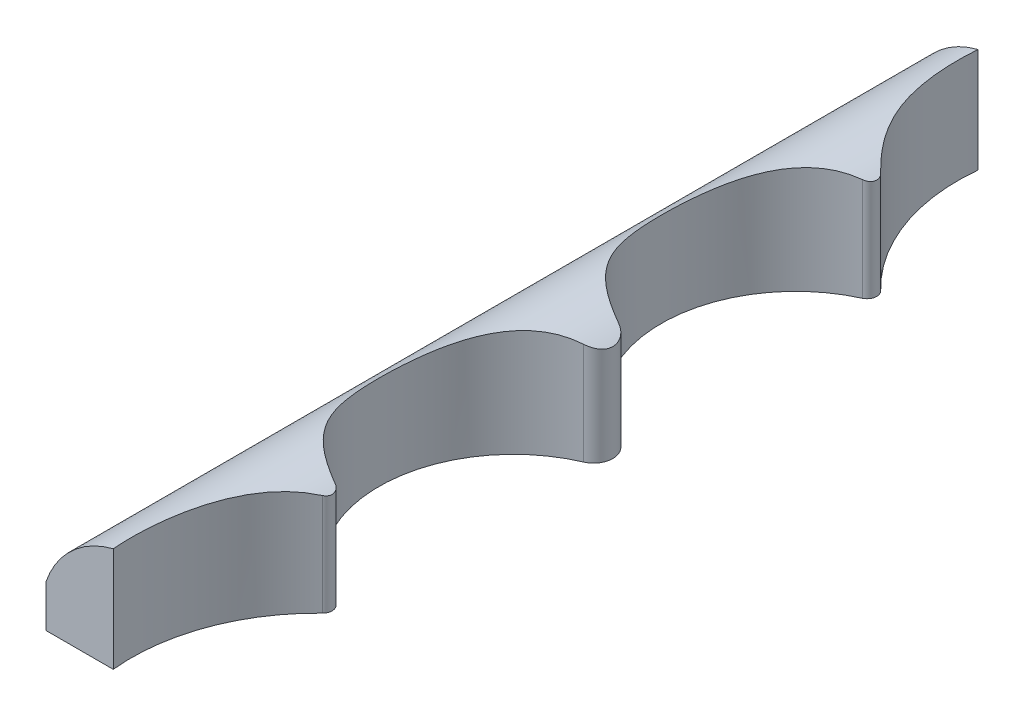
from build123d import *

# Parameters (mm, degrees)
CROQUIS1_W              = 80
CROQUIS1_H              = 70
EXTRUIR1_DEPTH          = 235
CROQUIS2_W              = 80
CROQUIS2_H              = 10
CORTE_LARGO_DEPTH       = 249.445164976
PERFILADO_FRONTAL_DEPTH = 240.008368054
PERFILADO_LATERAL_DEPTH = 454.128017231


with BuildPart() as part:
    # Croquis1 → Extruir1 (new, symmetric)
    with BuildSketch(Plane.XY):
        Rectangle(CROQUIS1_W, CROQUIS1_H)
    extrude(amount=EXTRUIR1_DEPTH, both=True)

    # Croquis2 → Corte - largo (cut, through all)
    with BuildSketch(Plane(origin=(0, 35, 0), x_dir=(1, 0, 0), z_dir=(0, 1, 0))):
        with Locations((0, 230)):
            Rectangle(CROQUIS2_W, CROQUIS2_H)
        with Locations((0, -230)):
            Rectangle(CROQUIS2_W, CROQUIS2_H)
    extrude(amount=-CORTE_LARGO_DEPTH, mode=Mode.SUBTRACT)

    # Croquis3 → Perfilado frontal (cut, through all)
    with BuildSketch(Plane(origin=(0, 35, 0), x_dir=(1, 0, 0), z_dir=(0, 1, 0))):
        with BuildLine():
            Line((40, -225), (40, 225))
            Line((40, 225), (-5, 225))
            ThreePointArc((-5, 225), (0.356806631, 181.797125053), (24.065450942, 145.285702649))
            ThreePointArc((24.065450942, 145.285702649), (25.517375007, 140.843357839), (22.664072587, 137.141847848))
            ThreePointArc((22.664072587, 137.141847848), (-18.292472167, 72.739192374), (23.962990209, 9.181214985))
            ThreePointArc((23.962990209, 9.181214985), (30, 0), (23.962990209, -9.181214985))
            ThreePointArc((23.962990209, -9.181214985), (-18.292472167, -72.739192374), (22.664072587, -137.141847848))
            ThreePointArc((22.664072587, -137.141847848), (25.517375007, -140.843357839), (24.065450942, -145.285702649))
            ThreePointArc((24.065450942, -145.285702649), (0.356806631, -181.797125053), (-5, -225))
            Line((-5, -225), (40, -225))
        make_face()
    extrude(amount=-PERFILADO_FRONTAL_DEPTH, mode=Mode.SUBTRACT)

    # Croquis4 → Perfilado lateral (cut, through all)
    with BuildSketch(Plane.XY.offset(225)):
        with BuildLine():
            Line((44.065450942, 35), (-40, 35))
            Line((-40, 35), (-40, -13))
            ThreePointArc((-40, -13), (-3.042204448, 19.826210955), (44.065450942, 4.849309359))
            Line((44.065450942, 4.849309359), (44.065450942, 35))
        make_face()
    extrude(amount=-PERFILADO_LATERAL_DEPTH, mode=Mode.SUBTRACT)


solid = part.part
